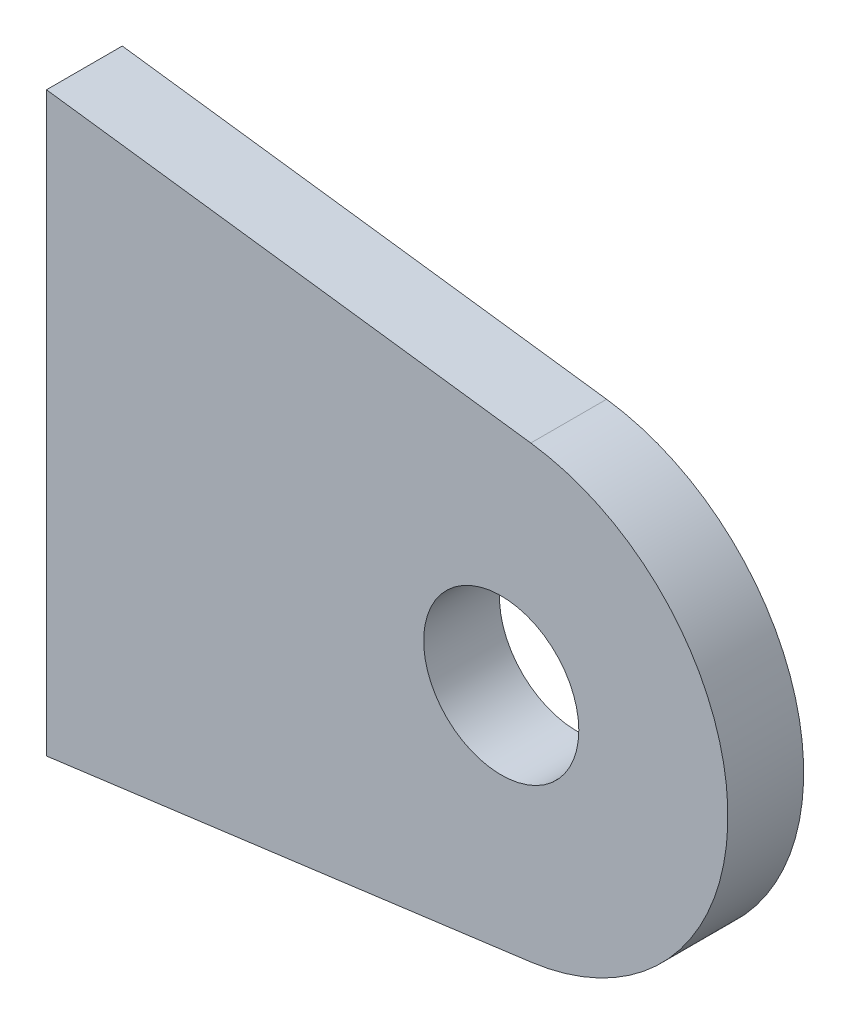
from build123d import *

# Parameters (mm, degrees)
SKETCH1_R           = 3.25
BOSS_EXTRUDE1_DEPTH = 3.175


with BuildPart() as part:
    # Sketch1 → Boss-Extrude1 (new body)
    with BuildSketch(Plane(origin=(-1053.740804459, 0, 0), x_dir=(1, 0, 0), z_dir=(0, 0, 1))):
        with BuildLine():
            Line((1034.690804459, -12.085852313), (1054.980272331, -9.414693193))
            ThreePointArc((1054.980272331, -9.414693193), (1063.236736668, 0), (1054.980272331, 9.414693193))
            Line((1054.980272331, 9.414693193), (1034.690804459, 12.085852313))
            Line((1034.690804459, 12.085852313), (1034.690804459, -12.085852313))
        make_face()
        with Locations((1053.740804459, 0)):
            Circle(SKETCH1_R, mode=Mode.SUBTRACT)
    extrude(amount=BOSS_EXTRUDE1_DEPTH)


solid = part.part
